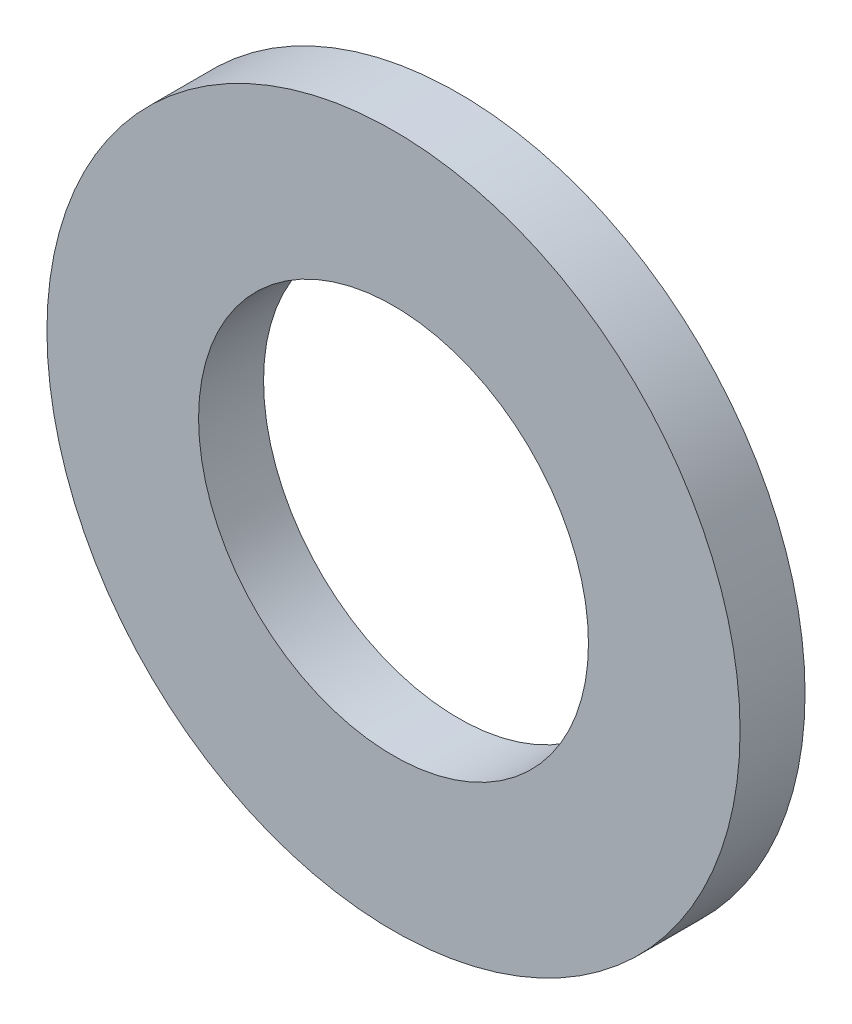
from build123d import *

# Parameters (mm, degrees)
ESQUISSE1_R             = 16
BASE_EXTRUSION_DEPTH    = 3
ESQUISSE2_R             = 9
ENL_V_MAT_EXTRU_1_DEPTH = 3


with BuildPart() as part:
    # Esquisse1 → Base-Extrusion (new body)
    with BuildSketch(Plane.XY):
        Circle(ESQUISSE1_R)
    extrude(amount=-BASE_EXTRUSION_DEPTH)

    # Esquisse2 → Enl_v. mat.-Extru.1 (cut)
    with BuildSketch(Plane.XY):
        Circle(ESQUISSE2_R)
    extrude(amount=-ENL_V_MAT_EXTRU_1_DEPTH, mode=Mode.SUBTRACT)


solid = part.part
